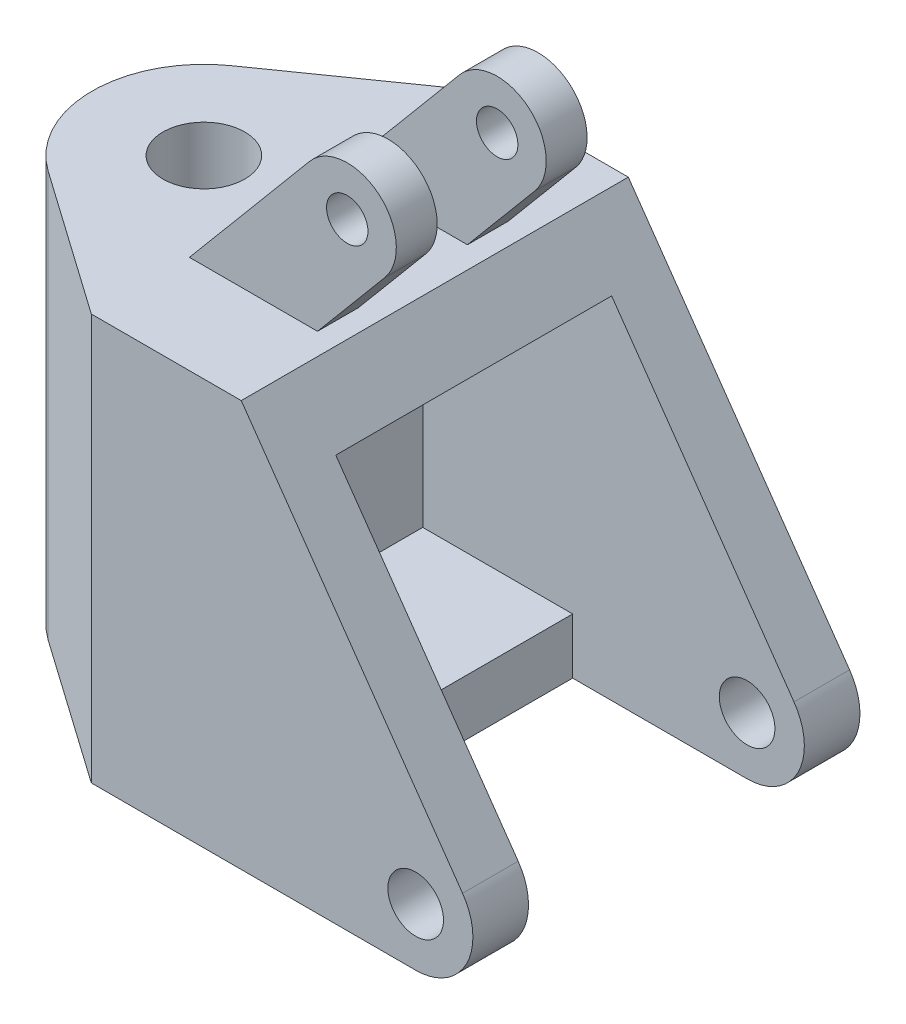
ISO-10303-21;
HEADER;
FILE_DESCRIPTION(('STEP AP214'),'2;1');
FILE_NAME('part.step','',(''),(''),'','','');
FILE_SCHEMA(('AUTOMOTIVE_DESIGN { 1 0 10303 214 1 1 1 1 }'));
ENDSEC;
DATA;
#1=APPLICATION_CONTEXT('core data for automotive mechanical design processes');
#2=APPLICATION_PROTOCOL_DEFINITION('international standard','automotive_design',2000,#1);
#3=PRODUCT_CONTEXT('',#1,'mechanical');
#4=PRODUCT('Part','Part','',(#3));
#5=PRODUCT_RELATED_PRODUCT_CATEGORY('part','',(#4));
#6=PRODUCT_DEFINITION_FORMATION('','',#4);
#7=PRODUCT_DEFINITION_CONTEXT('part definition',#1,'design');
#8=PRODUCT_DEFINITION('design','',#6,#7);
#9=PRODUCT_DEFINITION_SHAPE('','',#8);
#10=(LENGTH_UNIT() NAMED_UNIT(*) SI_UNIT(.MILLI.,.METRE.));
#11=(NAMED_UNIT(*) PLANE_ANGLE_UNIT() SI_UNIT($,.RADIAN.));
#12=(NAMED_UNIT(*) SI_UNIT($,.STERADIAN.) SOLID_ANGLE_UNIT());
#13=UNCERTAINTY_MEASURE_WITH_UNIT(LENGTH_MEASURE(1.E-05),#10,'distance_accuracy_value','');
#14=(GEOMETRIC_REPRESENTATION_CONTEXT(3) GLOBAL_UNCERTAINTY_ASSIGNED_CONTEXT((#13)) GLOBAL_UNIT_ASSIGNED_CONTEXT((#10,
#11,#12)) REPRESENTATION_CONTEXT('',''));
#15=CARTESIAN_POINT('',(0.,0.,0.));
#16=DIRECTION('',(0.,0.,1.));
#17=DIRECTION('',(1.,0.,0.));
#18=AXIS2_PLACEMENT_3D('',#15,#16,#17);
#19=CARTESIAN_POINT('',(105.,538.,-253.));
#20=DIRECTION('',(0.,1.,0.));
#21=DIRECTION('',(0.,0.,1.));
#22=AXIS2_PLACEMENT_3D('',#19,#20,#21);
#23=PLANE('',#22);
#24=DIRECTION('',(0.,0.,-1.));
#25=VECTOR('',#24,1.);
#26=CARTESIAN_POINT('',(-595.,538.,-355.));
#27=LINE('',#26,#25);
#28=CARTESIAN_POINT('',(-595.,538.,253.));
#29=VERTEX_POINT('',#28);
#30=CARTESIAN_POINT('',(-595.,538.,-253.));
#31=VERTEX_POINT('',#30);
#32=EDGE_CURVE('E213',#29,#31,#27,.T.);
#33=ORIENTED_EDGE('',*,*,#32,.T.);
#34=DIRECTION('',(-1.,0.,0.));
#35=VECTOR('',#34,1.);
#36=CARTESIAN_POINT('',(105.,538.,-253.));
#37=LINE('',#36,#35);
#38=CARTESIAN_POINT('',(-248.530323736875,538.,-253.));
#39=VERTEX_POINT('',#38);
#40=EDGE_CURVE('E323',#39,#31,#37,.T.);
#41=ORIENTED_EDGE('',*,*,#40,.F.);
#42=DIRECTION('',(0.,0.,1.));
#43=VECTOR('',#42,1.);
#44=CARTESIAN_POINT('',(-248.530323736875,538.,355.));
#45=LINE('',#44,#43);
#46=CARTESIAN_POINT('',(-248.530323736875,538.,253.));
#47=VERTEX_POINT('',#46);
#48=EDGE_CURVE('E341',#39,#47,#45,.T.);
#49=ORIENTED_EDGE('',*,*,#48,.T.);
#50=DIRECTION('',(-1.,0.,0.));
#51=VECTOR('',#50,1.);
#52=CARTESIAN_POINT('',(105.,538.,253.));
#53=LINE('',#52,#51);
#54=EDGE_CURVE('E327',#47,#29,#53,.T.);
#55=ORIENTED_EDGE('',*,*,#54,.T.);
#56=EDGE_LOOP('',(#33,#41,#49,#55));
#57=FACE_BOUND('',#56,.T.);
#58=ADVANCED_FACE('F35',(#57),#23,.F.);
#59=CARTESIAN_POINT('',(0.,0.,355.));
#60=DIRECTION('',(0.,0.,-1.));
#61=DIRECTION('',(-1.,0.,0.));
#62=AXIS2_PLACEMENT_3D('',#59,#60,#61);
#63=CYLINDRICAL_SURFACE('',#62,105.);
#64=DIRECTION('',(0.,0.,-1.));
#65=VECTOR('',#64,1.);
#66=CARTESIAN_POINT('',(0.,-105.,355.));
#67=LINE('',#66,#65);
#68=CARTESIAN_POINT('',(0.,-105.,355.));
#69=VERTEX_POINT('',#68);
#70=CARTESIAN_POINT('',(0.,-105.,253.));
#71=VERTEX_POINT('',#70);
#72=EDGE_CURVE('E381',#69,#71,#67,.T.);
#73=ORIENTED_EDGE('',*,*,#72,.T.);
#74=CARTESIAN_POINT('',(0.,0.,253.));
#75=DIRECTION('',(0.,0.,1.));
#76=DIRECTION('',(1.,0.,0.));
#77=AXIS2_PLACEMENT_3D('',#74,#75,#76);
#78=CIRCLE('',#77,105.);
#79=CARTESIAN_POINT('',(86.0109646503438,60.2255258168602,253.));
#80=VERTEX_POINT('',#79);
#81=EDGE_CURVE('E335',#71,#80,#78,.T.);
#82=ORIENTED_EDGE('',*,*,#81,.T.);
#83=DIRECTION('',(0.,0.,-1.));
#84=VECTOR('',#83,1.);
#85=CARTESIAN_POINT('',(86.0109646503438,60.2255258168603,355.));
#86=LINE('',#85,#84);
#87=CARTESIAN_POINT('',(86.0109646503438,60.2255258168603,355.));
#88=VERTEX_POINT('',#87);
#89=EDGE_CURVE('E377',#88,#80,#86,.T.);
#90=ORIENTED_EDGE('',*,*,#89,.F.);
#91=CARTESIAN_POINT('',(0.,0.,355.));
#92=DIRECTION('',(0.,0.,1.));
#93=DIRECTION('',(1.,0.,0.));
#94=AXIS2_PLACEMENT_3D('',#91,#92,#93);
#95=CIRCLE('',#94,105.);
#96=EDGE_CURVE('E346',#69,#88,#95,.T.);
#97=ORIENTED_EDGE('',*,*,#96,.F.);
#98=EDGE_LOOP('',(#73,#82,#90,#97));
#99=FACE_BOUND('',#98,.T.);
#100=ADVANCED_FACE('F392',(#99),#63,.T.);
#101=CARTESIAN_POINT('',(0.,0.,355.));
#102=DIRECTION('',(0.,0.,-1.));
#103=DIRECTION('',(-1.,0.,0.));
#104=AXIS2_PLACEMENT_3D('',#101,#102,#103);
#105=CYLINDRICAL_SURFACE('',#104,51.);
#106=CARTESIAN_POINT('',(0.,0.,253.));
#107=DIRECTION('',(0.,0.,1.));
#108=DIRECTION('',(1.,0.,0.));
#109=AXIS2_PLACEMENT_3D('',#106,#107,#108);
#110=CIRCLE('',#109,51.);
#111=CARTESIAN_POINT('',(51.,0.,253.));
#112=VERTEX_POINT('',#111);
#113=EDGE_CURVE('E43',#112,#112,#110,.T.);
#114=ORIENTED_EDGE('',*,*,#113,.F.);
#115=EDGE_LOOP('',(#114));
#116=FACE_BOUND('',#115,.T.);
#117=CARTESIAN_POINT('',(0.,0.,355.));
#118=DIRECTION('',(0.,0.,1.));
#119=DIRECTION('',(1.,0.,0.));
#120=AXIS2_PLACEMENT_3D('',#117,#118,#119);
#121=CIRCLE('',#120,51.);
#122=CARTESIAN_POINT('',(51.,0.,355.));
#123=VERTEX_POINT('',#122);
#124=EDGE_CURVE('E357',#123,#123,#121,.T.);
#125=ORIENTED_EDGE('',*,*,#124,.T.);
#126=EDGE_LOOP('',(#125));
#127=FACE_BOUND('',#126,.T.);
#128=ADVANCED_FACE('F389',(#116,#127),#105,.F.);
#129=CARTESIAN_POINT('',(0.,-105.,355.));
#130=DIRECTION('',(0.,-1.,0.));
#131=DIRECTION('',(1.,0.,0.));
#132=AXIS2_PLACEMENT_3D('',#129,#130,#131);
#133=PLANE('',#132);
#134=DIRECTION('',(-1.,0.,0.));
#135=VECTOR('',#134,1.);
#136=CARTESIAN_POINT('',(105.,-105.,253.));
#137=LINE('',#136,#135);
#138=CARTESIAN_POINT('',(-320.,-105.,253.));
#139=VERTEX_POINT('',#138);
#140=EDGE_CURVE('E301',#71,#139,#137,.T.);
#141=ORIENTED_EDGE('',*,*,#140,.F.);
#142=ORIENTED_EDGE('',*,*,#72,.F.);
#143=DIRECTION('',(-1.,0.,0.));
#144=VECTOR('',#143,1.);
#145=CARTESIAN_POINT('',(0.,-105.,355.));
#146=LINE('',#145,#144);
#147=CARTESIAN_POINT('',(-595.,-105.,355.));
#148=VERTEX_POINT('',#147);
#149=EDGE_CURVE('E208',#69,#148,#146,.T.);
#150=ORIENTED_EDGE('',*,*,#149,.T.);
#151=DIRECTION('',(0.818083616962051,0.,0.575099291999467));
#152=VECTOR('',#151,1.);
#153=CARTESIAN_POINT('',(-861.425678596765,-105.,167.707141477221));
#154=LINE('',#153,#152);
#155=CARTESIAN_POINT('',(-861.425678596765,-105.,167.70714147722));
#156=VERTEX_POINT('',#155);
#157=EDGE_CURVE('E188',#156,#148,#154,.T.);
#158=ORIENTED_EDGE('',*,*,#157,.F.);
#159=CARTESIAN_POINT('',(-743.530323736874,-105.,0.));
#160=DIRECTION('',(0.,1.,0.));
#161=DIRECTION('',(0.,0.,1.));
#162=AXIS2_PLACEMENT_3D('',#159,#160,#161);
#163=CIRCLE('',#162,205.);
#164=CARTESIAN_POINT('',(-861.425678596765,-105.,-167.707141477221));
#165=VERTEX_POINT('',#164);
#166=EDGE_CURVE('E198',#165,#156,#163,.T.);
#167=ORIENTED_EDGE('',*,*,#166,.F.);
#168=DIRECTION('',(-0.818083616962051,0.,0.575099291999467));
#169=VECTOR('',#168,1.);
#170=CARTESIAN_POINT('',(-595.,-105.,-355.));
#171=LINE('',#170,#169);
#172=CARTESIAN_POINT('',(-595.,-105.,-355.));
#173=VERTEX_POINT('',#172);
#174=EDGE_CURVE('E203',#173,#165,#171,.T.);
#175=ORIENTED_EDGE('',*,*,#174,.F.);
#176=DIRECTION('',(-1.,0.,0.));
#177=VECTOR('',#176,1.);
#178=CARTESIAN_POINT('',(0.,-105.,-355.));
#179=LINE('',#178,#177);
#180=CARTESIAN_POINT('',(0.,-105.,-355.));
#181=VERTEX_POINT('',#180);
#182=EDGE_CURVE('E344',#181,#173,#179,.T.);
#183=ORIENTED_EDGE('',*,*,#182,.F.);
#184=CARTESIAN_POINT('',(0.,-105.,-253.));
#185=VERTEX_POINT('',#184);
#186=EDGE_CURVE('E380',#185,#181,#67,.T.);
#187=ORIENTED_EDGE('',*,*,#186,.F.);
#188=DIRECTION('',(1.,0.,0.));
#189=VECTOR('',#188,1.);
#190=CARTESIAN_POINT('',(105.,-105.,-253.));
#191=LINE('',#190,#189);
#192=CARTESIAN_POINT('',(-320.,-105.,-253.));
#193=VERTEX_POINT('',#192);
#194=EDGE_CURVE('E307',#193,#185,#191,.T.);
#195=ORIENTED_EDGE('',*,*,#194,.F.);
#196=DIRECTION('',(0.,0.,-1.));
#197=VECTOR('',#196,1.);
#198=CARTESIAN_POINT('',(-320.,-105.,253.));
#199=LINE('',#198,#197);
#200=EDGE_CURVE('E304',#139,#193,#199,.T.);
#201=ORIENTED_EDGE('',*,*,#200,.F.);
#202=EDGE_LOOP('',(#141,#142,#150,#158,#167,#175,#183,#187,#195,#201));
#203=FACE_BOUND('',#202,.T.);
#204=CARTESIAN_POINT('',(-743.530323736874,-105.,0.));
#205=DIRECTION('',(0.,1.,0.));
#206=DIRECTION('',(0.,0.,1.));
#207=AXIS2_PLACEMENT_3D('',#204,#205,#206);
#208=CIRCLE('',#207,74.9999999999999);
#209=CARTESIAN_POINT('',(-743.530323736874,-105.,74.9999999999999));
#210=VERTEX_POINT('',#209);
#211=EDGE_CURVE('E210',#210,#210,#208,.T.);
#212=ORIENTED_EDGE('',*,*,#211,.T.);
#213=EDGE_LOOP('',(#212));
#214=FACE_BOUND('',#213,.T.);
#215=ADVANCED_FACE('F37',(#203,#214),#133,.T.);
#216=CARTESIAN_POINT('',(0.,0.,-253.));
#217=DIRECTION('',(0.,0.,-1.));
#218=DIRECTION('',(0.,1.,0.));
#219=AXIS2_PLACEMENT_3D('',#216,#217,#218);
#220=CIRCLE('',#219,105.);
#221=CARTESIAN_POINT('',(86.0109646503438,60.2255258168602,-253.));
#222=VERTEX_POINT('',#221);
#223=EDGE_CURVE('E339',#222,#185,#220,.T.);
#224=ORIENTED_EDGE('',*,*,#223,.T.);
#225=ORIENTED_EDGE('',*,*,#186,.T.);
#226=CARTESIAN_POINT('',(0.,0.,-355.));
#227=DIRECTION('',(0.,0.,1.));
#228=DIRECTION('',(1.,0.,0.));
#229=AXIS2_PLACEMENT_3D('',#226,#227,#228);
#230=CIRCLE('',#229,105.);
#231=CARTESIAN_POINT('',(86.0109646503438,60.2255258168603,-355.));
#232=VERTEX_POINT('',#231);
#233=EDGE_CURVE('E362',#181,#232,#230,.T.);
#234=ORIENTED_EDGE('',*,*,#233,.T.);
#235=EDGE_CURVE('E376',#222,#232,#86,.T.);
#236=ORIENTED_EDGE('',*,*,#235,.F.);
#237=EDGE_LOOP('',(#224,#225,#234,#236));
#238=FACE_BOUND('',#237,.T.);
#239=ADVANCED_FACE('F419',(#238),#63,.T.);
#240=CARTESIAN_POINT('',(86.0109646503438,60.2255258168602,355.));
#241=DIRECTION('',(0.819152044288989,0.57357643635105,0.));
#242=DIRECTION('',(-0.57357643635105,0.819152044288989,0.));
#243=AXIS2_PLACEMENT_3D('',#240,#241,#242);
#244=PLANE('',#243);
#245=DIRECTION('',(-0.57357643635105,0.819152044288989,0.));
#246=VECTOR('',#245,1.);
#247=CARTESIAN_POINT('',(86.0109646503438,60.2255258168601,-253.));
#248=LINE('',#247,#246);
#249=EDGE_CURVE('E337',#222,#39,#248,.T.);
#250=ORIENTED_EDGE('',*,*,#249,.F.);
#251=ORIENTED_EDGE('',*,*,#235,.T.);
#252=DIRECTION('',(0.57357643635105,-0.819152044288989,0.));
#253=VECTOR('',#252,1.);
#254=CARTESIAN_POINT('',(86.0109646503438,60.2255258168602,-355.));
#255=LINE('',#254,#253);
#256=CARTESIAN_POINT('',(-319.951492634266,640.,-355.));
#257=VERTEX_POINT('',#256);
#258=EDGE_CURVE('E365',#257,#232,#255,.T.);
#259=ORIENTED_EDGE('',*,*,#258,.F.);
#260=DIRECTION('',(0.,0.,-1.));
#261=VECTOR('',#260,1.);
#262=CARTESIAN_POINT('',(-319.951492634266,640.,355.));
#263=LINE('',#262,#261);
#264=CARTESIAN_POINT('',(-319.951492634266,640.,355.));
#265=VERTEX_POINT('',#264);
#266=EDGE_CURVE('E360',#265,#257,#263,.T.);
#267=ORIENTED_EDGE('',*,*,#266,.F.);
#268=DIRECTION('',(0.57357643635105,-0.819152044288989,0.));
#269=VECTOR('',#268,1.);
#270=CARTESIAN_POINT('',(86.0109646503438,60.2255258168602,355.));
#271=LINE('',#270,#269);
#272=EDGE_CURVE('E349',#265,#88,#271,.T.);
#273=ORIENTED_EDGE('',*,*,#272,.T.);
#274=ORIENTED_EDGE('',*,*,#89,.T.);
#275=DIRECTION('',(0.57357643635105,-0.819152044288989,0.));
#276=VECTOR('',#275,1.);
#277=CARTESIAN_POINT('',(86.0109646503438,60.2255258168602,253.));
#278=LINE('',#277,#276);
#279=EDGE_CURVE('E326',#47,#80,#278,.T.);
#280=ORIENTED_EDGE('',*,*,#279,.F.);
#281=ORIENTED_EDGE('',*,*,#48,.F.);
#282=EDGE_LOOP('',(#250,#251,#259,#267,#273,#274,#280,#281));
#283=FACE_BOUND('',#282,.T.);
#284=ADVANCED_FACE('F443',(#283),#244,.T.);
#285=CARTESIAN_POINT('',(0.,640.,355.));
#286=DIRECTION('',(0.,1.,0.));
#287=DIRECTION('',(0.,0.,1.));
#288=AXIS2_PLACEMENT_3D('',#285,#286,#287);
#289=PLANE('',#288);
#290=DIRECTION('',(-1.,0.,0.));
#291=VECTOR('',#290,1.);
#292=CARTESIAN_POINT('',(0.,640.,175.));
#293=LINE('',#292,#291);
#294=CARTESIAN_POINT('',(-360.02668792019,640.,175.));
#295=VERTEX_POINT('',#294);
#296=CARTESIAN_POINT('',(-595.,640.,175.));
#297=VERTEX_POINT('',#296);
#298=EDGE_CURVE('E271',#295,#297,#293,.T.);
#299=ORIENTED_EDGE('',*,*,#298,.T.);
#300=DIRECTION('',(0.,0.,-1.));
#301=VECTOR('',#300,1.);
#302=CARTESIAN_POINT('',(-595.,640.,175.));
#303=LINE('',#302,#301);
#304=CARTESIAN_POINT('',(-595.,640.,100.));
#305=VERTEX_POINT('',#304);
#306=EDGE_CURVE('E294',#297,#305,#303,.T.);
#307=ORIENTED_EDGE('',*,*,#306,.T.);
#308=DIRECTION('',(-1.,0.,0.));
#309=VECTOR('',#308,1.);
#310=CARTESIAN_POINT('',(0.,640.,100.));
#311=LINE('',#310,#309);
#312=CARTESIAN_POINT('',(-360.02668792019,640.,100.));
#313=VERTEX_POINT('',#312);
#314=EDGE_CURVE('E286',#313,#305,#311,.T.);
#315=ORIENTED_EDGE('',*,*,#314,.F.);
#316=DIRECTION('',(0.,0.,-1.));
#317=VECTOR('',#316,1.);
#318=CARTESIAN_POINT('',(-360.02668792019,640.,175.));
#319=LINE('',#318,#317);
#320=EDGE_CURVE('E292',#295,#313,#319,.T.);
#321=ORIENTED_EDGE('',*,*,#320,.F.);
#322=EDGE_LOOP('',(#299,#307,#315,#321));
#323=FACE_BOUND('',#322,.T.);
#324=DIRECTION('',(-1.,0.,0.));
#325=VECTOR('',#324,1.);
#326=CARTESIAN_POINT('',(0.,640.,-100.));
#327=LINE('',#326,#325);
#328=CARTESIAN_POINT('',(-360.02668792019,640.,-100.));
#329=VERTEX_POINT('',#328);
#330=CARTESIAN_POINT('',(-595.,640.,-100.));
#331=VERTEX_POINT('',#330);
#332=EDGE_CURVE('E249',#329,#331,#327,.T.);
#333=ORIENTED_EDGE('',*,*,#332,.T.);
#334=DIRECTION('',(0.,0.,1.));
#335=VECTOR('',#334,1.);
#336=CARTESIAN_POINT('',(-595.,640.,-175.));
#337=LINE('',#336,#335);
#338=CARTESIAN_POINT('',(-595.,640.,-175.));
#339=VERTEX_POINT('',#338);
#340=EDGE_CURVE('E255',#339,#331,#337,.T.);
#341=ORIENTED_EDGE('',*,*,#340,.F.);
#342=DIRECTION('',(-1.,0.,0.));
#343=VECTOR('',#342,1.);
#344=CARTESIAN_POINT('',(0.,640.,-175.));
#345=LINE('',#344,#343);
#346=CARTESIAN_POINT('',(-360.02668792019,640.,-175.));
#347=VERTEX_POINT('',#346);
#348=EDGE_CURVE('E50',#347,#339,#345,.T.);
#349=ORIENTED_EDGE('',*,*,#348,.F.);
#350=DIRECTION('',(0.,0.,1.));
#351=VECTOR('',#350,1.);
#352=CARTESIAN_POINT('',(-360.02668792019,640.,-175.));
#353=LINE('',#352,#351);
#354=EDGE_CURVE('E258',#347,#329,#353,.T.);
#355=ORIENTED_EDGE('',*,*,#354,.T.);
#356=EDGE_LOOP('',(#333,#341,#349,#355));
#357=FACE_BOUND('',#356,.T.);
#358=DIRECTION('',(0.818083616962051,0.,0.575099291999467));
#359=VECTOR('',#358,1.);
#360=CARTESIAN_POINT('',(-861.425678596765,640.,167.707141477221));
#361=LINE('',#360,#359);
#362=CARTESIAN_POINT('',(-861.425678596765,640.,167.70714147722));
#363=VERTEX_POINT('',#362);
#364=CARTESIAN_POINT('',(-595.,640.,355.));
#365=VERTEX_POINT('',#364);
#366=EDGE_CURVE('E190',#363,#365,#361,.T.);
#367=ORIENTED_EDGE('',*,*,#366,.T.);
#368=DIRECTION('',(1.,0.,0.));
#369=VECTOR('',#368,1.);
#370=CARTESIAN_POINT('',(0.,640.,355.));
#371=LINE('',#370,#369);
#372=EDGE_CURVE('E352',#365,#265,#371,.T.);
#373=ORIENTED_EDGE('',*,*,#372,.T.);
#374=ORIENTED_EDGE('',*,*,#266,.T.);
#375=DIRECTION('',(1.,0.,0.));
#376=VECTOR('',#375,1.);
#377=CARTESIAN_POINT('',(0.,640.,-355.));
#378=LINE('',#377,#376);
#379=CARTESIAN_POINT('',(-595.,640.,-355.));
#380=VERTEX_POINT('',#379);
#381=EDGE_CURVE('E368',#380,#257,#378,.T.);
#382=ORIENTED_EDGE('',*,*,#381,.F.);
#383=DIRECTION('',(-0.818083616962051,0.,0.575099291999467));
#384=VECTOR('',#383,1.);
#385=CARTESIAN_POINT('',(-595.,640.,-355.));
#386=LINE('',#385,#384);
#387=CARTESIAN_POINT('',(-861.425678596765,640.,-167.707141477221));
#388=VERTEX_POINT('',#387);
#389=EDGE_CURVE('E221',#380,#388,#386,.T.);
#390=ORIENTED_EDGE('',*,*,#389,.T.);
#391=CARTESIAN_POINT('',(-743.530323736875,640.,0.));
#392=DIRECTION('',(0.,1.,0.));
#393=DIRECTION('',(0.,0.,1.));
#394=AXIS2_PLACEMENT_3D('',#391,#392,#393);
#395=CIRCLE('',#394,205.);
#396=EDGE_CURVE('E224',#388,#363,#395,.T.);
#397=ORIENTED_EDGE('',*,*,#396,.T.);
#398=EDGE_LOOP('',(#367,#373,#374,#382,#390,#397));
#399=FACE_BOUND('',#398,.T.);
#400=CARTESIAN_POINT('',(-743.530323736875,640.,0.));
#401=DIRECTION('',(0.,1.,0.));
#402=DIRECTION('',(0.,0.,1.));
#403=AXIS2_PLACEMENT_3D('',#400,#401,#402);
#404=CIRCLE('',#403,74.9999999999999);
#405=CARTESIAN_POINT('',(-743.530323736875,640.,74.9999999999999));
#406=VERTEX_POINT('',#405);
#407=EDGE_CURVE('E218',#406,#406,#404,.T.);
#408=ORIENTED_EDGE('',*,*,#407,.F.);
#409=EDGE_LOOP('',(#408));
#410=FACE_BOUND('',#409,.T.);
#411=ADVANCED_FACE('F409',(#323,#357,#399,#410),#289,.T.);
#412=CARTESIAN_POINT('',(0.,0.,-253.));
#413=DIRECTION('',(0.,0.,-1.));
#414=DIRECTION('',(0.,1.,0.));
#415=AXIS2_PLACEMENT_3D('',#412,#413,#414);
#416=CIRCLE('',#415,51.);
#417=CARTESIAN_POINT('',(0.,51.,-253.));
#418=VERTEX_POINT('',#417);
#419=EDGE_CURVE('E11',#418,#418,#416,.T.);
#420=ORIENTED_EDGE('',*,*,#419,.F.);
#421=EDGE_LOOP('',(#420));
#422=FACE_BOUND('',#421,.T.);
#423=CARTESIAN_POINT('',(0.,0.,-355.));
#424=DIRECTION('',(0.,0.,1.));
#425=DIRECTION('',(1.,0.,0.));
#426=AXIS2_PLACEMENT_3D('',#423,#424,#425);
#427=CIRCLE('',#426,51.);
#428=CARTESIAN_POINT('',(51.,0.,-355.));
#429=VERTEX_POINT('',#428);
#430=EDGE_CURVE('E347',#429,#429,#427,.T.);
#431=ORIENTED_EDGE('',*,*,#430,.F.);
#432=EDGE_LOOP('',(#431));
#433=FACE_BOUND('',#432,.T.);
#434=ADVANCED_FACE('F394',(#422,#433),#105,.F.);
#435=CARTESIAN_POINT('',(0.,0.,355.));
#436=DIRECTION('',(0.,0.,1.));
#437=DIRECTION('',(1.,0.,0.));
#438=AXIS2_PLACEMENT_3D('',#435,#436,#437);
#439=PLANE('',#438);
#440=ORIENTED_EDGE('',*,*,#149,.F.);
#441=ORIENTED_EDGE('',*,*,#96,.T.);
#442=ORIENTED_EDGE('',*,*,#272,.F.);
#443=ORIENTED_EDGE('',*,*,#372,.F.);
#444=DIRECTION('',(0.,1.,0.));
#445=VECTOR('',#444,1.);
#446=CARTESIAN_POINT('',(-595.,0.,355.));
#447=LINE('',#446,#445);
#448=EDGE_CURVE('E355',#148,#365,#447,.T.);
#449=ORIENTED_EDGE('',*,*,#448,.F.);
#450=EDGE_LOOP('',(#440,#441,#442,#443,#449));
#451=FACE_BOUND('',#450,.T.);
#452=ORIENTED_EDGE('',*,*,#124,.F.);
#453=EDGE_LOOP('',(#452));
#454=FACE_BOUND('',#453,.T.);
#455=ADVANCED_FACE('F397',(#451,#454),#439,.T.);
#456=CARTESIAN_POINT('',(0.,0.,-355.));
#457=DIRECTION('',(0.,0.,1.));
#458=DIRECTION('',(1.,0.,0.));
#459=AXIS2_PLACEMENT_3D('',#456,#457,#458);
#460=PLANE('',#459);
#461=ORIENTED_EDGE('',*,*,#182,.T.);
#462=DIRECTION('',(0.,1.,0.));
#463=VECTOR('',#462,1.);
#464=CARTESIAN_POINT('',(-595.,0.,-355.));
#465=LINE('',#464,#463);
#466=EDGE_CURVE('E371',#173,#380,#465,.T.);
#467=ORIENTED_EDGE('',*,*,#466,.T.);
#468=ORIENTED_EDGE('',*,*,#381,.T.);
#469=ORIENTED_EDGE('',*,*,#258,.T.);
#470=ORIENTED_EDGE('',*,*,#233,.F.);
#471=EDGE_LOOP('',(#461,#467,#468,#469,#470));
#472=FACE_BOUND('',#471,.T.);
#473=ORIENTED_EDGE('',*,*,#430,.T.);
#474=EDGE_LOOP('',(#473));
#475=FACE_BOUND('',#474,.T.);
#476=ADVANCED_FACE('F399',(#472,#475),#460,.F.);
#477=CARTESIAN_POINT('',(105.,538.,-253.));
#478=DIRECTION('',(0.,0.,-1.));
#479=DIRECTION('',(0.,1.,0.));
#480=AXIS2_PLACEMENT_3D('',#477,#478,#479);
#481=PLANE('',#480);
#482=ORIENTED_EDGE('',*,*,#419,.T.);
#483=EDGE_LOOP('',(#482));
#484=FACE_BOUND('',#483,.T.);
#485=ORIENTED_EDGE('',*,*,#223,.F.);
#486=ORIENTED_EDGE('',*,*,#249,.T.);
#487=ORIENTED_EDGE('',*,*,#40,.T.);
#488=DIRECTION('',(0.,-1.,0.));
#489=VECTOR('',#488,1.);
#490=CARTESIAN_POINT('',(-595.,538.,-253.));
#491=LINE('',#490,#489);
#492=CARTESIAN_POINT('',(-595.,-3.0000000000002,-253.));
#493=VERTEX_POINT('',#492);
#494=EDGE_CURVE('E313',#31,#493,#491,.T.);
#495=ORIENTED_EDGE('',*,*,#494,.T.);
#496=DIRECTION('',(-1.,0.,0.));
#497=VECTOR('',#496,1.);
#498=CARTESIAN_POINT('',(105.,-3.0000000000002,-253.));
#499=LINE('',#498,#497);
#500=CARTESIAN_POINT('',(-320.,-3.0000000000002,-253.));
#501=VERTEX_POINT('',#500);
#502=EDGE_CURVE('E322',#501,#493,#499,.T.);
#503=ORIENTED_EDGE('',*,*,#502,.F.);
#504=DIRECTION('',(0.,-1.,0.));
#505=VECTOR('',#504,1.);
#506=CARTESIAN_POINT('',(-320.,640.001,-253.));
#507=LINE('',#506,#505);
#508=EDGE_CURVE('E311',#501,#193,#507,.T.);
#509=ORIENTED_EDGE('',*,*,#508,.T.);
#510=ORIENTED_EDGE('',*,*,#194,.T.);
#511=EDGE_LOOP('',(#485,#486,#487,#495,#503,#509,#510));
#512=FACE_BOUND('',#511,.T.);
#513=ADVANCED_FACE('F406',(#484,#512),#481,.F.);
#514=CARTESIAN_POINT('',(105.,538.,253.));
#515=DIRECTION('',(0.,0.,1.));
#516=DIRECTION('',(1.,0.,0.));
#517=AXIS2_PLACEMENT_3D('',#514,#515,#516);
#518=PLANE('',#517);
#519=ORIENTED_EDGE('',*,*,#113,.T.);
#520=EDGE_LOOP('',(#519));
#521=FACE_BOUND('',#520,.T.);
#522=ORIENTED_EDGE('',*,*,#81,.F.);
#523=ORIENTED_EDGE('',*,*,#140,.T.);
#524=DIRECTION('',(0.,-1.,0.));
#525=VECTOR('',#524,1.);
#526=CARTESIAN_POINT('',(-320.,640.001,253.));
#527=LINE('',#526,#525);
#528=CARTESIAN_POINT('',(-320.,-3.00000000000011,253.));
#529=VERTEX_POINT('',#528);
#530=EDGE_CURVE('E310',#529,#139,#527,.T.);
#531=ORIENTED_EDGE('',*,*,#530,.F.);
#532=DIRECTION('',(-1.,0.,0.));
#533=VECTOR('',#532,1.);
#534=CARTESIAN_POINT('',(105.,-3.00000000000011,253.));
#535=LINE('',#534,#533);
#536=CARTESIAN_POINT('',(-595.,-3.00000000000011,253.));
#537=VERTEX_POINT('',#536);
#538=EDGE_CURVE('E330',#529,#537,#535,.T.);
#539=ORIENTED_EDGE('',*,*,#538,.T.);
#540=DIRECTION('',(0.,1.,0.));
#541=VECTOR('',#540,1.);
#542=CARTESIAN_POINT('',(-595.,538.,253.));
#543=LINE('',#542,#541);
#544=EDGE_CURVE('E320',#537,#29,#543,.T.);
#545=ORIENTED_EDGE('',*,*,#544,.T.);
#546=ORIENTED_EDGE('',*,*,#54,.F.);
#547=ORIENTED_EDGE('',*,*,#279,.T.);
#548=EDGE_LOOP('',(#522,#523,#531,#539,#545,#546,#547));
#549=FACE_BOUND('',#548,.T.);
#550=ADVANCED_FACE('F386',(#521,#549),#518,.F.);
#551=CARTESIAN_POINT('',(105.,-3.0000000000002,-253.));
#552=DIRECTION('',(0.,-1.,0.));
#553=DIRECTION('',(0.,0.,-1.));
#554=AXIS2_PLACEMENT_3D('',#551,#552,#553);
#555=PLANE('',#554);
#556=ORIENTED_EDGE('',*,*,#538,.F.);
#557=DIRECTION('',(0.,0.,1.));
#558=VECTOR('',#557,1.);
#559=CARTESIAN_POINT('',(-320.,-3.00000000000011,253.));
#560=LINE('',#559,#558);
#561=EDGE_CURVE('E299',#501,#529,#560,.T.);
#562=ORIENTED_EDGE('',*,*,#561,.F.);
#563=ORIENTED_EDGE('',*,*,#502,.T.);
#564=DIRECTION('',(0.,0.,1.));
#565=VECTOR('',#564,1.);
#566=CARTESIAN_POINT('',(-595.,-3.0000000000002,-253.));
#567=LINE('',#566,#565);
#568=EDGE_CURVE('E317',#493,#537,#567,.T.);
#569=ORIENTED_EDGE('',*,*,#568,.T.);
#570=EDGE_LOOP('',(#556,#562,#563,#569));
#571=FACE_BOUND('',#570,.T.);
#572=ADVANCED_FACE('F426',(#571),#555,.F.);
#573=CARTESIAN_POINT('',(-320.,640.001,253.));
#574=DIRECTION('',(-1.,0.,0.));
#575=DIRECTION('',(0.,0.,1.));
#576=AXIS2_PLACEMENT_3D('',#573,#574,#575);
#577=PLANE('',#576);
#578=ORIENTED_EDGE('',*,*,#561,.T.);
#579=ORIENTED_EDGE('',*,*,#530,.T.);
#580=ORIENTED_EDGE('',*,*,#200,.T.);
#581=ORIENTED_EDGE('',*,*,#508,.F.);
#582=EDGE_LOOP('',(#578,#579,#580,#581));
#583=FACE_BOUND('',#582,.T.);
#584=ADVANCED_FACE('F422',(#583),#577,.F.);
#585=CARTESIAN_POINT('',(-305.497919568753,845.,175.));
#586=DIRECTION('',(0.,0.,-1.));
#587=DIRECTION('',(-1.,0.,0.));
#588=AXIS2_PLACEMENT_3D('',#585,#586,#587);
#589=CYLINDRICAL_SURFACE('',#588,90.);
#590=CARTESIAN_POINT('',(-305.497919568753,845.,100.));
#591=DIRECTION('',(0.,0.,1.));
#592=DIRECTION('',(1.,0.,0.));
#593=AXIS2_PLACEMENT_3D('',#590,#591,#592);
#594=CIRCLE('',#593,90.);
#595=CARTESIAN_POINT('',(-236.553919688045,787.149115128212,100.));
#596=VERTEX_POINT('',#595);
#597=CARTESIAN_POINT('',(-374.441919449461,902.850884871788,100.));
#598=VERTEX_POINT('',#597);
#599=EDGE_CURVE('E280',#596,#598,#594,.T.);
#600=ORIENTED_EDGE('',*,*,#599,.T.);
#601=DIRECTION('',(0.,0.,-1.));
#602=VECTOR('',#601,1.);
#603=CARTESIAN_POINT('',(-374.441919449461,902.850884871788,175.));
#604=LINE('',#603,#602);
#605=CARTESIAN_POINT('',(-374.441919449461,902.850884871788,175.));
#606=VERTEX_POINT('',#605);
#607=EDGE_CURVE('E297',#606,#598,#604,.T.);
#608=ORIENTED_EDGE('',*,*,#607,.F.);
#609=CARTESIAN_POINT('',(-305.497919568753,845.,175.));
#610=DIRECTION('',(0.,0.,1.));
#611=DIRECTION('',(1.,0.,0.));
#612=AXIS2_PLACEMENT_3D('',#609,#610,#611);
#613=CIRCLE('',#612,90.);
#614=CARTESIAN_POINT('',(-236.553919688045,787.149115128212,175.));
#615=VERTEX_POINT('',#614);
#616=EDGE_CURVE('E267',#615,#606,#613,.T.);
#617=ORIENTED_EDGE('',*,*,#616,.F.);
#618=DIRECTION('',(0.,0.,-1.));
#619=VECTOR('',#618,1.);
#620=CARTESIAN_POINT('',(-236.553919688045,787.149115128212,175.));
#621=LINE('',#620,#619);
#622=EDGE_CURVE('E277',#615,#596,#621,.T.);
#623=ORIENTED_EDGE('',*,*,#622,.T.);
#624=EDGE_LOOP('',(#600,#608,#617,#623));
#625=FACE_BOUND('',#624,.T.);
#626=ADVANCED_FACE('F527',(#625),#589,.T.);
#627=CARTESIAN_POINT('',(-664.298813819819,557.412889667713,175.));
#628=DIRECTION('',(-0.766044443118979,0.642787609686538,0.));
#629=DIRECTION('',(-0.642787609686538,-0.766044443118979,0.));
#630=AXIS2_PLACEMENT_3D('',#627,#628,#629);
#631=PLANE('',#630);
#632=DIRECTION('',(0.642787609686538,0.766044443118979,0.));
#633=VECTOR('',#632,1.);
#634=CARTESIAN_POINT('',(-664.298813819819,557.412889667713,100.));
#635=LINE('',#634,#633);
#636=EDGE_CURVE('E283',#305,#598,#635,.T.);
#637=ORIENTED_EDGE('',*,*,#636,.F.);
#638=ORIENTED_EDGE('',*,*,#306,.F.);
#639=DIRECTION('',(0.642787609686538,0.766044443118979,0.));
#640=VECTOR('',#639,1.);
#641=CARTESIAN_POINT('',(-664.298813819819,557.412889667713,175.));
#642=LINE('',#641,#640);
#643=EDGE_CURVE('E58',#297,#606,#642,.T.);
#644=ORIENTED_EDGE('',*,*,#643,.T.);
#645=ORIENTED_EDGE('',*,*,#607,.T.);
#646=EDGE_LOOP('',(#637,#638,#644,#645));
#647=FACE_BOUND('',#646,.T.);
#648=ADVANCED_FACE('F524',(#647),#631,.T.);
#649=CARTESIAN_POINT('',(-305.497919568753,845.,175.));
#650=DIRECTION('',(0.,0.,-1.));
#651=DIRECTION('',(-1.,0.,0.));
#652=AXIS2_PLACEMENT_3D('',#649,#650,#651);
#653=CYLINDRICAL_SURFACE('',#652,38.);
#654=CARTESIAN_POINT('',(-305.497919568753,845.,175.));
#655=DIRECTION('',(0.,0.,1.));
#656=DIRECTION('',(1.,0.,0.));
#657=AXIS2_PLACEMENT_3D('',#654,#655,#656);
#658=CIRCLE('',#657,38.);
#659=CARTESIAN_POINT('',(-267.497919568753,845.,175.));
#660=VERTEX_POINT('',#659);
#661=EDGE_CURVE('E264',#660,#660,#658,.T.);
#662=ORIENTED_EDGE('',*,*,#661,.T.);
#663=EDGE_LOOP('',(#662));
#664=FACE_BOUND('',#663,.T.);
#665=CARTESIAN_POINT('',(-305.497919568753,845.,100.));
#666=DIRECTION('',(0.,0.,1.));
#667=DIRECTION('',(1.,0.,0.));
#668=AXIS2_PLACEMENT_3D('',#665,#666,#667);
#669=CIRCLE('',#668,38.);
#670=CARTESIAN_POINT('',(-267.497919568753,845.,100.));
#671=VERTEX_POINT('',#670);
#672=EDGE_CURVE('E263',#671,#671,#669,.T.);
#673=ORIENTED_EDGE('',*,*,#672,.F.);
#674=EDGE_LOOP('',(#673));
#675=FACE_BOUND('',#674,.T.);
#676=ADVANCED_FACE('F522',(#664,#675),#653,.F.);
#677=CARTESIAN_POINT('',(-526.410814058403,441.711119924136,175.));
#678=DIRECTION('',(0.766044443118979,-0.642787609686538,0.));
#679=DIRECTION('',(0.642787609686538,0.766044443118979,0.));
#680=AXIS2_PLACEMENT_3D('',#677,#678,#679);
#681=PLANE('',#680);
#682=DIRECTION('',(-0.642787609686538,-0.766044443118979,0.));
#683=VECTOR('',#682,1.);
#684=CARTESIAN_POINT('',(-526.410814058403,441.711119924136,100.));
#685=LINE('',#684,#683);
#686=EDGE_CURVE('E268',#596,#313,#685,.T.);
#687=ORIENTED_EDGE('',*,*,#686,.F.);
#688=ORIENTED_EDGE('',*,*,#622,.F.);
#689=DIRECTION('',(-0.642787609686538,-0.766044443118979,0.));
#690=VECTOR('',#689,1.);
#691=CARTESIAN_POINT('',(-526.410814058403,441.711119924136,175.));
#692=LINE('',#691,#690);
#693=EDGE_CURVE('E274',#615,#295,#692,.T.);
#694=ORIENTED_EDGE('',*,*,#693,.T.);
#695=ORIENTED_EDGE('',*,*,#320,.T.);
#696=EDGE_LOOP('',(#687,#688,#694,#695));
#697=FACE_BOUND('',#696,.T.);
#698=ADVANCED_FACE('F515',(#697),#681,.T.);
#699=CARTESIAN_POINT('',(0.,0.,175.));
#700=DIRECTION('',(0.,0.,1.));
#701=DIRECTION('',(1.,0.,0.));
#702=AXIS2_PLACEMENT_3D('',#699,#700,#701);
#703=PLANE('',#702);
#704=ORIENTED_EDGE('',*,*,#661,.F.);
#705=EDGE_LOOP('',(#704));
#706=FACE_BOUND('',#705,.T.);
#707=ORIENTED_EDGE('',*,*,#616,.T.);
#708=ORIENTED_EDGE('',*,*,#643,.F.);
#709=ORIENTED_EDGE('',*,*,#298,.F.);
#710=ORIENTED_EDGE('',*,*,#693,.F.);
#711=EDGE_LOOP('',(#707,#708,#709,#710));
#712=FACE_BOUND('',#711,.T.);
#713=ADVANCED_FACE('F512',(#706,#712),#703,.T.);
#714=CARTESIAN_POINT('',(0.,0.,100.));
#715=DIRECTION('',(0.,0.,1.));
#716=DIRECTION('',(1.,0.,0.));
#717=AXIS2_PLACEMENT_3D('',#714,#715,#716);
#718=PLANE('',#717);
#719=ORIENTED_EDGE('',*,*,#672,.T.);
#720=EDGE_LOOP('',(#719));
#721=FACE_BOUND('',#720,.T.);
#722=ORIENTED_EDGE('',*,*,#599,.F.);
#723=ORIENTED_EDGE('',*,*,#686,.T.);
#724=ORIENTED_EDGE('',*,*,#314,.T.);
#725=ORIENTED_EDGE('',*,*,#636,.T.);
#726=EDGE_LOOP('',(#722,#723,#724,#725));
#727=FACE_BOUND('',#726,.T.);
#728=ADVANCED_FACE('F507',(#721,#727),#718,.F.);
#729=CARTESIAN_POINT('',(-305.497919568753,845.,-175.));
#730=DIRECTION('',(0.,0.,1.));
#731=DIRECTION('',(1.,0.,0.));
#732=AXIS2_PLACEMENT_3D('',#729,#730,#731);
#733=CYLINDRICAL_SURFACE('',#732,90.);
#734=CARTESIAN_POINT('',(-305.497919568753,845.,-100.));
#735=DIRECTION('',(0.,0.,1.));
#736=DIRECTION('',(1.,0.,0.));
#737=AXIS2_PLACEMENT_3D('',#734,#735,#736);
#738=CIRCLE('',#737,90.);
#739=CARTESIAN_POINT('',(-236.553919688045,787.149115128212,-100.));
#740=VERTEX_POINT('',#739);
#741=CARTESIAN_POINT('',(-374.441919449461,902.850884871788,-100.));
#742=VERTEX_POINT('',#741);
#743=EDGE_CURVE('E243',#740,#742,#738,.T.);
#744=ORIENTED_EDGE('',*,*,#743,.F.);
#745=DIRECTION('',(0.,0.,1.));
#746=VECTOR('',#745,1.);
#747=CARTESIAN_POINT('',(-236.553919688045,787.149115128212,-175.));
#748=LINE('',#747,#746);
#749=CARTESIAN_POINT('',(-236.553919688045,787.149115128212,-175.));
#750=VERTEX_POINT('',#749);
#751=EDGE_CURVE('E261',#750,#740,#748,.T.);
#752=ORIENTED_EDGE('',*,*,#751,.F.);
#753=CARTESIAN_POINT('',(-305.497919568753,845.,-175.));
#754=DIRECTION('',(0.,0.,1.));
#755=DIRECTION('',(1.,0.,0.));
#756=AXIS2_PLACEMENT_3D('',#753,#754,#755);
#757=CIRCLE('',#756,90.);
#758=CARTESIAN_POINT('',(-374.441919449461,902.850884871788,-175.));
#759=VERTEX_POINT('',#758);
#760=EDGE_CURVE('E231',#750,#759,#757,.T.);
#761=ORIENTED_EDGE('',*,*,#760,.T.);
#762=DIRECTION('',(0.,0.,1.));
#763=VECTOR('',#762,1.);
#764=CARTESIAN_POINT('',(-374.441919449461,902.850884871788,-175.));
#765=LINE('',#764,#763);
#766=EDGE_CURVE('E240',#759,#742,#765,.T.);
#767=ORIENTED_EDGE('',*,*,#766,.T.);
#768=EDGE_LOOP('',(#744,#752,#761,#767));
#769=FACE_BOUND('',#768,.T.);
#770=ADVANCED_FACE('F503',(#769),#733,.T.);
#771=CARTESIAN_POINT('',(-526.410814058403,441.711119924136,-175.));
#772=DIRECTION('',(-0.766044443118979,0.642787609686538,0.));
#773=DIRECTION('',(-0.642787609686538,-0.766044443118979,0.));
#774=AXIS2_PLACEMENT_3D('',#771,#772,#773);
#775=PLANE('',#774);
#776=DIRECTION('',(-0.642787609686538,-0.766044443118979,0.));
#777=VECTOR('',#776,1.);
#778=CARTESIAN_POINT('',(-526.410814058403,441.711119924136,-100.));
#779=LINE('',#778,#777);
#780=EDGE_CURVE('E246',#740,#329,#779,.T.);
#781=ORIENTED_EDGE('',*,*,#780,.T.);
#782=ORIENTED_EDGE('',*,*,#354,.F.);
#783=DIRECTION('',(-0.642787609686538,-0.766044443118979,0.));
#784=VECTOR('',#783,1.);
#785=CARTESIAN_POINT('',(-526.410814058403,441.711119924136,-175.));
#786=LINE('',#785,#784);
#787=EDGE_CURVE('E235',#750,#347,#786,.T.);
#788=ORIENTED_EDGE('',*,*,#787,.F.);
#789=ORIENTED_EDGE('',*,*,#751,.T.);
#790=EDGE_LOOP('',(#781,#782,#788,#789));
#791=FACE_BOUND('',#790,.T.);
#792=ADVANCED_FACE('F500',(#791),#775,.F.);
#793=CARTESIAN_POINT('',(-305.497919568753,845.,-175.));
#794=DIRECTION('',(0.,0.,1.));
#795=DIRECTION('',(1.,0.,0.));
#796=AXIS2_PLACEMENT_3D('',#793,#794,#795);
#797=CYLINDRICAL_SURFACE('',#796,38.);
#798=CARTESIAN_POINT('',(-305.497919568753,845.,-175.));
#799=DIRECTION('',(0.,0.,1.));
#800=DIRECTION('',(1.,0.,0.));
#801=AXIS2_PLACEMENT_3D('',#798,#799,#800);
#802=CIRCLE('',#801,38.);
#803=CARTESIAN_POINT('',(-267.497919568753,845.,-175.));
#804=VERTEX_POINT('',#803);
#805=EDGE_CURVE('E228',#804,#804,#802,.T.);
#806=ORIENTED_EDGE('',*,*,#805,.F.);
#807=EDGE_LOOP('',(#806));
#808=FACE_BOUND('',#807,.T.);
#809=CARTESIAN_POINT('',(-305.497919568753,845.,-100.));
#810=DIRECTION('',(0.,0.,1.));
#811=DIRECTION('',(1.,0.,0.));
#812=AXIS2_PLACEMENT_3D('',#809,#810,#811);
#813=CIRCLE('',#812,38.);
#814=CARTESIAN_POINT('',(-267.497919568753,845.,-100.));
#815=VERTEX_POINT('',#814);
#816=EDGE_CURVE('E194',#815,#815,#813,.T.);
#817=ORIENTED_EDGE('',*,*,#816,.T.);
#818=EDGE_LOOP('',(#817));
#819=FACE_BOUND('',#818,.T.);
#820=ADVANCED_FACE('F498',(#808,#819),#797,.F.);
#821=CARTESIAN_POINT('',(-664.298813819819,557.412889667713,-175.));
#822=DIRECTION('',(0.766044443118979,-0.642787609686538,0.));
#823=DIRECTION('',(0.642787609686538,0.766044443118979,0.));
#824=AXIS2_PLACEMENT_3D('',#821,#822,#823);
#825=PLANE('',#824);
#826=DIRECTION('',(0.642787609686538,0.766044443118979,0.));
#827=VECTOR('',#826,1.);
#828=CARTESIAN_POINT('',(-664.298813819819,557.412889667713,-100.));
#829=LINE('',#828,#827);
#830=EDGE_CURVE('E232',#331,#742,#829,.T.);
#831=ORIENTED_EDGE('',*,*,#830,.T.);
#832=ORIENTED_EDGE('',*,*,#766,.F.);
#833=DIRECTION('',(0.642787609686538,0.766044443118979,0.));
#834=VECTOR('',#833,1.);
#835=CARTESIAN_POINT('',(-664.298813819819,557.412889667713,-175.));
#836=LINE('',#835,#834);
#837=EDGE_CURVE('E238',#339,#759,#836,.T.);
#838=ORIENTED_EDGE('',*,*,#837,.F.);
#839=ORIENTED_EDGE('',*,*,#340,.T.);
#840=EDGE_LOOP('',(#831,#832,#838,#839));
#841=FACE_BOUND('',#840,.T.);
#842=ADVANCED_FACE('F491',(#841),#825,.F.);
#843=CARTESIAN_POINT('',(0.,0.,-175.));
#844=DIRECTION('',(0.,0.,-1.));
#845=DIRECTION('',(1.,0.,0.));
#846=AXIS2_PLACEMENT_3D('',#843,#844,#845);
#847=PLANE('',#846);
#848=ORIENTED_EDGE('',*,*,#805,.T.);
#849=EDGE_LOOP('',(#848));
#850=FACE_BOUND('',#849,.T.);
#851=ORIENTED_EDGE('',*,*,#760,.F.);
#852=ORIENTED_EDGE('',*,*,#787,.T.);
#853=ORIENTED_EDGE('',*,*,#348,.T.);
#854=ORIENTED_EDGE('',*,*,#837,.T.);
#855=EDGE_LOOP('',(#851,#852,#853,#854));
#856=FACE_BOUND('',#855,.T.);
#857=ADVANCED_FACE('F488',(#850,#856),#847,.T.);
#858=CARTESIAN_POINT('',(0.,0.,-100.));
#859=DIRECTION('',(0.,0.,-1.));
#860=DIRECTION('',(1.,0.,0.));
#861=AXIS2_PLACEMENT_3D('',#858,#859,#860);
#862=PLANE('',#861);
#863=ORIENTED_EDGE('',*,*,#816,.F.);
#864=EDGE_LOOP('',(#863));
#865=FACE_BOUND('',#864,.T.);
#866=ORIENTED_EDGE('',*,*,#743,.T.);
#867=ORIENTED_EDGE('',*,*,#830,.F.);
#868=ORIENTED_EDGE('',*,*,#332,.F.);
#869=ORIENTED_EDGE('',*,*,#780,.F.);
#870=EDGE_LOOP('',(#866,#867,#868,#869));
#871=FACE_BOUND('',#870,.T.);
#872=ADVANCED_FACE('F487',(#865,#871),#862,.F.);
#873=CARTESIAN_POINT('',(-595.,-255.147962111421,-355.));
#874=DIRECTION('',(-0.575099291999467,0.,-0.818083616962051));
#875=DIRECTION('',(-0.818083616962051,0.,0.575099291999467));
#876=AXIS2_PLACEMENT_3D('',#873,#874,#875);
#877=PLANE('',#876);
#878=ORIENTED_EDGE('',*,*,#389,.F.);
#879=ORIENTED_EDGE('',*,*,#466,.F.);
#880=ORIENTED_EDGE('',*,*,#174,.T.);
#881=DIRECTION('',(0.,1.,0.));
#882=VECTOR('',#881,1.);
#883=CARTESIAN_POINT('',(-861.425678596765,-255.147962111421,-167.707141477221));
#884=LINE('',#883,#882);
#885=EDGE_CURVE('E195',#165,#388,#884,.T.);
#886=ORIENTED_EDGE('',*,*,#885,.T.);
#887=EDGE_LOOP('',(#878,#879,#880,#886));
#888=FACE_BOUND('',#887,.T.);
#889=ADVANCED_FACE('F459',(#888),#877,.T.);
#890=CARTESIAN_POINT('',(-743.530323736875,-255.147962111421,0.));
#891=DIRECTION('',(0.,1.,0.));
#892=DIRECTION('',(0.,0.,1.));
#893=AXIS2_PLACEMENT_3D('',#890,#891,#892);
#894=CYLINDRICAL_SURFACE('',#893,205.);
#895=ORIENTED_EDGE('',*,*,#885,.F.);
#896=ORIENTED_EDGE('',*,*,#166,.T.);
#897=DIRECTION('',(0.,1.,0.));
#898=VECTOR('',#897,1.);
#899=CARTESIAN_POINT('',(-861.425678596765,-255.147962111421,167.70714147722));
#900=LINE('',#899,#898);
#901=EDGE_CURVE('E184',#156,#363,#900,.T.);
#902=ORIENTED_EDGE('',*,*,#901,.T.);
#903=ORIENTED_EDGE('',*,*,#396,.F.);
#904=EDGE_LOOP('',(#895,#896,#902,#903));
#905=FACE_BOUND('',#904,.T.);
#906=ADVANCED_FACE('F199',(#905),#894,.T.);
#907=CARTESIAN_POINT('',(-861.425678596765,-255.147962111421,167.707141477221));
#908=DIRECTION('',(-0.575099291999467,0.,0.818083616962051));
#909=DIRECTION('',(0.818083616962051,0.,0.575099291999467));
#910=AXIS2_PLACEMENT_3D('',#907,#908,#909);
#911=PLANE('',#910);
#912=ORIENTED_EDGE('',*,*,#901,.F.);
#913=ORIENTED_EDGE('',*,*,#157,.T.);
#914=ORIENTED_EDGE('',*,*,#448,.T.);
#915=ORIENTED_EDGE('',*,*,#366,.F.);
#916=EDGE_LOOP('',(#912,#913,#914,#915));
#917=FACE_BOUND('',#916,.T.);
#918=ADVANCED_FACE('F186',(#917),#911,.T.);
#919=CARTESIAN_POINT('',(-743.530323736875,-255.147962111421,0.));
#920=DIRECTION('',(0.,1.,0.));
#921=DIRECTION('',(0.,0.,1.));
#922=AXIS2_PLACEMENT_3D('',#919,#920,#921);
#923=CYLINDRICAL_SURFACE('',#922,74.9999999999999);
#924=ORIENTED_EDGE('',*,*,#407,.T.);
#925=EDGE_LOOP('',(#924));
#926=FACE_BOUND('',#925,.T.);
#927=ORIENTED_EDGE('',*,*,#211,.F.);
#928=EDGE_LOOP('',(#927));
#929=FACE_BOUND('',#928,.T.);
#930=ADVANCED_FACE('F473',(#926,#929),#923,.F.);
#931=CARTESIAN_POINT('',(-595.,1331.14796211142,-355.));
#932=DIRECTION('',(-1.,0.,0.));
#933=DIRECTION('',(0.,-1.,0.));
#934=AXIS2_PLACEMENT_3D('',#931,#932,#933);
#935=PLANE('',#934);
#936=ORIENTED_EDGE('',*,*,#568,.F.);
#937=ORIENTED_EDGE('',*,*,#494,.F.);
#938=ORIENTED_EDGE('',*,*,#32,.F.);
#939=ORIENTED_EDGE('',*,*,#544,.F.);
#940=EDGE_LOOP('',(#936,#937,#938,#939));
#941=FACE_BOUND('',#940,.T.);
#942=ADVANCED_FACE('F471',(#941),#935,.F.);
#943=CLOSED_SHELL('',(#58,#100,#128,#215,#239,#284,#411,#434,#455,#476,#513,#550,#572,#584,#626,
#648,#676,#698,#713,#728,#770,#792,#820,#842,#857,#872,#889,#906,#918,#930,#942));
#944=MANIFOLD_SOLID_BREP('B2',#943);
#945=ADVANCED_BREP_SHAPE_REPRESENTATION('',(#18,#944),#14);
#946=SHAPE_DEFINITION_REPRESENTATION(#9,#945);
ENDSEC;
END-ISO-10303-21;
